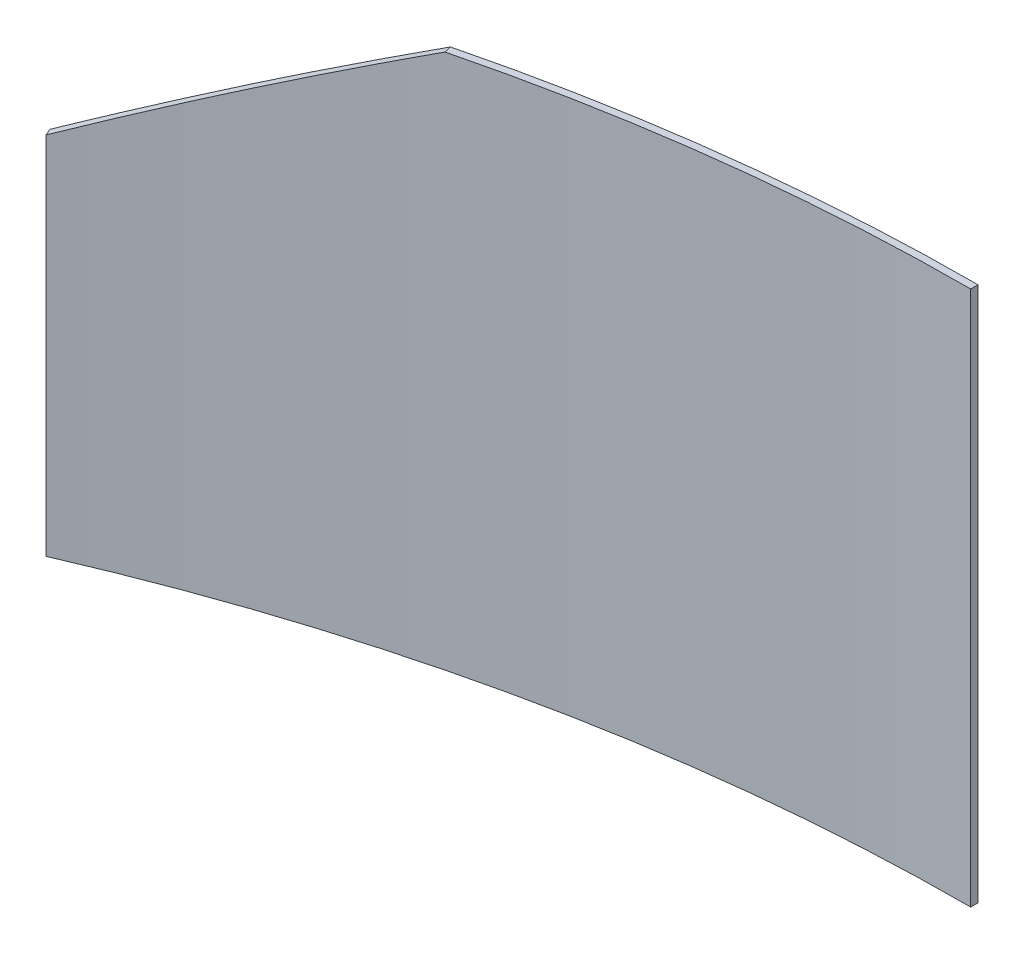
ISO-10303-21;
HEADER;
FILE_DESCRIPTION(('STEP AP214'),'2;1');
FILE_NAME('part.step','',(''),(''),'','','');
FILE_SCHEMA(('AUTOMOTIVE_DESIGN { 1 0 10303 214 1 1 1 1 }'));
ENDSEC;
DATA;
#1=APPLICATION_CONTEXT('core data for automotive mechanical design processes');
#2=APPLICATION_PROTOCOL_DEFINITION('international standard','automotive_design',2000,#1);
#3=PRODUCT_CONTEXT('',#1,'mechanical');
#4=PRODUCT('Part','Part','',(#3));
#5=PRODUCT_RELATED_PRODUCT_CATEGORY('part','',(#4));
#6=PRODUCT_DEFINITION_FORMATION('','',#4);
#7=PRODUCT_DEFINITION_CONTEXT('part definition',#1,'design');
#8=PRODUCT_DEFINITION('design','',#6,#7);
#9=PRODUCT_DEFINITION_SHAPE('','',#8);
#10=(LENGTH_UNIT() NAMED_UNIT(*) SI_UNIT(.MILLI.,.METRE.));
#11=(NAMED_UNIT(*) PLANE_ANGLE_UNIT() SI_UNIT($,.RADIAN.));
#12=(NAMED_UNIT(*) SI_UNIT($,.STERADIAN.) SOLID_ANGLE_UNIT());
#13=UNCERTAINTY_MEASURE_WITH_UNIT(LENGTH_MEASURE(1.E-05),#10,'distance_accuracy_value','');
#14=(GEOMETRIC_REPRESENTATION_CONTEXT(3) GLOBAL_UNCERTAINTY_ASSIGNED_CONTEXT((#13)) GLOBAL_UNIT_ASSIGNED_CONTEXT((#10,
#11,#12)) REPRESENTATION_CONTEXT('',''));
#15=CARTESIAN_POINT('',(0.,0.,0.));
#16=DIRECTION('',(0.,0.,1.));
#17=DIRECTION('',(1.,0.,0.));
#18=AXIS2_PLACEMENT_3D('',#15,#16,#17);
#19=CARTESIAN_POINT('',(-4.44089209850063E-13,220.,6.66133814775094E-13));
#20=DIRECTION('',(0.,-1.,0.));
#21=DIRECTION('',(0.,0.,-1.));
#22=AXIS2_PLACEMENT_3D('',#19,#20,#21);
#23=PLANE('',#22);
#24=DIRECTION('',(0.,0.,1.));
#25=VECTOR('',#24,1.);
#26=CARTESIAN_POINT('',(0.,220.,-793.));
#27=LINE('',#26,#25);
#28=CARTESIAN_POINT('',(1.11022302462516E-13,220.,-796.));
#29=VERTEX_POINT('',#28);
#30=CARTESIAN_POINT('',(0.,220.,-793.));
#31=VERTEX_POINT('',#30);
#32=EDGE_CURVE('E12',#29,#31,#27,.T.);
#33=ORIENTED_EDGE('',*,*,#32,.F.);
#34=CARTESIAN_POINT('',(-4.44089209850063E-13,220.,6.66133814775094E-13));
#35=DIRECTION('',(0.,-1.,0.));
#36=DIRECTION('',(0.,0.,-1.));
#37=AXIS2_PLACEMENT_3D('',#34,#35,#36);
#38=CIRCLE('',#37,796.);
#39=CARTESIAN_POINT('',(-193.055431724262,220.,-772.23416156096));
#40=VERTEX_POINT('',#39);
#41=EDGE_CURVE('E104',#29,#40,#38,.F.);
#42=ORIENTED_EDGE('',*,*,#41,.T.);
#43=CARTESIAN_POINT('',(-192.327835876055,220.,-769.323731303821));
#44=CARTESIAN_POINT('',(-193.055431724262,220.,-772.23416156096));
#45=B_SPLINE_CURVE_WITH_KNOTS('',1,(#43,#44),.UNSPECIFIED.,.F.,.F.,(2,2),(0.,1.),.UNSPECIFIED.);
#46=CARTESIAN_POINT('',(-192.327835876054,220.,-769.323731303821));
#47=VERTEX_POINT('',#46);
#48=EDGE_CURVE('E47',#40,#47,#45,.F.);
#49=ORIENTED_EDGE('',*,*,#48,.T.);
#50=CARTESIAN_POINT('',(-4.44089209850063E-13,220.,6.66133814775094E-13));
#51=DIRECTION('',(0.,1.,0.));
#52=DIRECTION('',(0.,0.,1.));
#53=AXIS2_PLACEMENT_3D('',#50,#51,#52);
#54=CIRCLE('',#53,793.);
#55=EDGE_CURVE('E170',#31,#47,#54,.T.);
#56=ORIENTED_EDGE('',*,*,#55,.F.);
#57=EDGE_LOOP('',(#33,#42,#49,#56));
#58=FACE_BOUND('',#57,.T.);
#59=ADVANCED_FACE('F38',(#58),#23,.F.);
#60=CARTESIAN_POINT('',(-193.055431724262,220.,-772.23416156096));
#61=CARTESIAN_POINT('',(-235.095669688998,196.666283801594,-761.724271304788));
#62=CARTESIAN_POINT('',(-276.273269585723,173.333716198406,-747.774645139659));
#63=CARTESIAN_POINT('',(-316.045278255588,150.000000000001,-730.569217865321));
#64=CARTESIAN_POINT('',(-192.327835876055,220.,-769.323731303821));
#65=CARTESIAN_POINT('',(-234.209629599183,196.666284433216,-758.853451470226));
#66=CARTESIAN_POINT('',(-275.232039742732,173.333715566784,-744.956398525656));
#67=CARTESIAN_POINT('',(-314.854152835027,150.000000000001,-727.815816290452));
#68=B_SPLINE_SURFACE_WITH_KNOTS('',1,3,((#60,#61,#62,#63),(#64,#65,#66,#67)),.UNSPECIFIED.,.F.,
.F.,.F.,(2,2),(4,4),(0.,1.),(0.,1.),.UNSPECIFIED.);
#69=CARTESIAN_POINT('',(-193.055431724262,220.,-772.23416156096));
#70=CARTESIAN_POINT('',(-235.095669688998,196.666283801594,-761.724271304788));
#71=CARTESIAN_POINT('',(-276.273269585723,173.333716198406,-747.774645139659));
#72=CARTESIAN_POINT('',(-316.045278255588,150.000000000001,-730.569217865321));
#73=B_SPLINE_CURVE_WITH_KNOTS('',3,(#69,#70,#71,#72),.UNSPECIFIED.,.F.,.F.,(4,4),(0.,1.),.UNSPECIFIED.);
#74=CARTESIAN_POINT('',(-316.045278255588,150.000000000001,-730.569217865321));
#75=VERTEX_POINT('',#74);
#76=EDGE_CURVE('E102',#40,#75,#73,.T.);
#77=CARTESIAN_POINT('',(-316.045278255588,150.000000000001,-730.569217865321));
#78=CARTESIAN_POINT('',(-314.854152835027,150.000000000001,-727.815816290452));
#79=B_SPLINE_CURVE_WITH_KNOTS('',1,(#77,#78),.UNSPECIFIED.,.F.,.F.,(2,2),(0.,1.),.UNSPECIFIED.);
#80=CARTESIAN_POINT('',(-314.854152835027,150.000000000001,-727.815816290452));
#81=VERTEX_POINT('',#80);
#82=EDGE_CURVE('E88',#75,#81,#79,.T.);
#83=CARTESIAN_POINT('',(-314.854152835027,150.000000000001,-727.815816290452));
#84=CARTESIAN_POINT('',(-275.232039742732,173.333715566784,-744.956398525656));
#85=CARTESIAN_POINT('',(-234.209629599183,196.666284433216,-758.853451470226));
#86=CARTESIAN_POINT('',(-192.327835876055,220.,-769.323731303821));
#87=B_SPLINE_CURVE_WITH_KNOTS('',3,(#83,#84,#85,#86),.UNSPECIFIED.,.F.,.F.,(4,4),(0.,1.),.UNSPECIFIED.);
#88=EDGE_CURVE('E177',#47,#81,#87,.F.);
#89=ORIENTED_EDGE('',*,*,#48,.F.);
#90=ORIENTED_EDGE('',*,*,#76,.T.);
#91=ORIENTED_EDGE('',*,*,#82,.T.);
#92=ORIENTED_EDGE('',*,*,#88,.F.);
#93=EDGE_LOOP('',(#89,#90,#91,#92));
#94=FACE_BOUND('',#93,.T.);
#95=ADVANCED_FACE('F135',(#94),#68,.F.);
#96=CARTESIAN_POINT('',(-314.854152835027,74.9999999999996,-727.815816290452));
#97=DIRECTION('',(0.917800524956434,0.,-0.397041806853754));
#98=DIRECTION('',(0.,-1.,0.));
#99=AXIS2_PLACEMENT_3D('',#96,#97,#98);
#100=PLANE('',#99);
#101=ORIENTED_EDGE('',*,*,#82,.F.);
#102=DIRECTION('',(0.,-1.,0.));
#103=VECTOR('',#102,1.);
#104=CARTESIAN_POINT('',(-316.045278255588,502.471655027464,-730.569217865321));
#105=LINE('',#104,#103);
#106=CARTESIAN_POINT('',(-316.045278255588,0.,-730.569217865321));
#107=VERTEX_POINT('',#106);
#108=EDGE_CURVE('E94',#75,#107,#105,.T.);
#109=ORIENTED_EDGE('',*,*,#108,.T.);
#110=DIRECTION('',(0.397041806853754,0.,0.917800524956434));
#111=VECTOR('',#110,1.);
#112=CARTESIAN_POINT('',(-314.854152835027,0.,-727.815816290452));
#113=LINE('',#112,#111);
#114=CARTESIAN_POINT('',(-314.854152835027,0.,-727.815816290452));
#115=VERTEX_POINT('',#114);
#116=EDGE_CURVE('E61',#107,#115,#113,.T.);
#117=ORIENTED_EDGE('',*,*,#116,.T.);
#118=DIRECTION('',(0.,-1.,0.));
#119=VECTOR('',#118,1.);
#120=CARTESIAN_POINT('',(-314.854152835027,150.000000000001,-727.815816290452));
#121=LINE('',#120,#119);
#122=EDGE_CURVE('E115',#81,#115,#121,.T.);
#123=ORIENTED_EDGE('',*,*,#122,.F.);
#124=EDGE_LOOP('',(#101,#109,#117,#123));
#125=FACE_BOUND('',#124,.T.);
#126=ADVANCED_FACE('F100',(#125),#100,.F.);
#127=CARTESIAN_POINT('',(0.,0.,0.));
#128=DIRECTION('',(0.,1.,0.));
#129=DIRECTION('',(0.,0.,1.));
#130=AXIS2_PLACEMENT_3D('',#127,#128,#129);
#131=PLANE('',#130);
#132=ORIENTED_EDGE('',*,*,#116,.F.);
#133=CARTESIAN_POINT('',(0.,0.,0.));
#134=DIRECTION('',(0.,-1.,0.));
#135=DIRECTION('',(0.,0.,-1.));
#136=AXIS2_PLACEMENT_3D('',#133,#134,#135);
#137=CIRCLE('',#136,796.);
#138=CARTESIAN_POINT('',(0.,0.,-796.));
#139=VERTEX_POINT('',#138);
#140=EDGE_CURVE('E85',#107,#139,#137,.T.);
#141=ORIENTED_EDGE('',*,*,#140,.T.);
#142=DIRECTION('',(0.,0.,1.));
#143=VECTOR('',#142,1.);
#144=CARTESIAN_POINT('',(0.,0.,-793.));
#145=LINE('',#144,#143);
#146=CARTESIAN_POINT('',(0.,0.,-793.));
#147=VERTEX_POINT('',#146);
#148=EDGE_CURVE('E42',#139,#147,#145,.T.);
#149=ORIENTED_EDGE('',*,*,#148,.T.);
#150=CARTESIAN_POINT('',(0.,0.,0.));
#151=DIRECTION('',(0.,-1.,0.));
#152=DIRECTION('',(0.,0.,-1.));
#153=AXIS2_PLACEMENT_3D('',#150,#151,#152);
#154=CIRCLE('',#153,793.);
#155=EDGE_CURVE('E87',#115,#147,#154,.T.);
#156=ORIENTED_EDGE('',*,*,#155,.F.);
#157=EDGE_LOOP('',(#132,#141,#149,#156));
#158=FACE_BOUND('',#157,.T.);
#159=ADVANCED_FACE('F84',(#158),#131,.F.);
#160=CARTESIAN_POINT('',(0.,110.,-793.));
#161=DIRECTION('',(-1.,0.,0.));
#162=DIRECTION('',(0.,1.,0.));
#163=AXIS2_PLACEMENT_3D('',#160,#161,#162);
#164=PLANE('',#163);
#165=DIRECTION('',(0.,-1.,0.));
#166=VECTOR('',#165,1.);
#167=CARTESIAN_POINT('',(2.22044604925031E-13,502.471655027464,-796.));
#168=LINE('',#167,#166);
#169=EDGE_CURVE('E98',#139,#29,#168,.F.);
#170=ORIENTED_EDGE('',*,*,#169,.T.);
#171=ORIENTED_EDGE('',*,*,#32,.T.);
#172=DIRECTION('',(0.,1.,0.));
#173=VECTOR('',#172,1.);
#174=CARTESIAN_POINT('',(0.,0.,-793.));
#175=LINE('',#174,#173);
#176=EDGE_CURVE('E107',#147,#31,#175,.T.);
#177=ORIENTED_EDGE('',*,*,#176,.F.);
#178=ORIENTED_EDGE('',*,*,#148,.F.);
#179=EDGE_LOOP('',(#170,#171,#177,#178));
#180=FACE_BOUND('',#179,.T.);
#181=ADVANCED_FACE('F40',(#180),#164,.F.);
#182=CARTESIAN_POINT('',(0.,502.471655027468,0.));
#183=DIRECTION('',(0.,-1.,0.));
#184=DIRECTION('',(0.,0.,-1.));
#185=AXIS2_PLACEMENT_3D('',#182,#183,#184);
#186=CYLINDRICAL_SURFACE('',#185,793.);
#187=ORIENTED_EDGE('',*,*,#155,.T.);
#188=ORIENTED_EDGE('',*,*,#176,.T.);
#189=ORIENTED_EDGE('',*,*,#55,.T.);
#190=ORIENTED_EDGE('',*,*,#88,.T.);
#191=ORIENTED_EDGE('',*,*,#122,.T.);
#192=EDGE_LOOP('',(#187,#188,#189,#190,#191));
#193=FACE_BOUND('',#192,.T.);
#194=ADVANCED_FACE('F118',(#193),#186,.F.);
#195=CARTESIAN_POINT('',(0.,502.471655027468,0.));
#196=DIRECTION('',(0.,-1.,0.));
#197=DIRECTION('',(0.,0.,-1.));
#198=AXIS2_PLACEMENT_3D('',#195,#196,#197);
#199=CYLINDRICAL_SURFACE('',#198,796.);
#200=ORIENTED_EDGE('',*,*,#140,.F.);
#201=ORIENTED_EDGE('',*,*,#108,.F.);
#202=ORIENTED_EDGE('',*,*,#76,.F.);
#203=ORIENTED_EDGE('',*,*,#41,.F.);
#204=ORIENTED_EDGE('',*,*,#169,.F.);
#205=EDGE_LOOP('',(#200,#201,#202,#203,#204));
#206=FACE_BOUND('',#205,.T.);
#207=ADVANCED_FACE('F92',(#206),#199,.T.);
#208=CLOSED_SHELL('',(#59,#95,#126,#159,#181,#194,#207));
#209=MANIFOLD_SOLID_BREP('B2',#208);
#210=ADVANCED_BREP_SHAPE_REPRESENTATION('',(#18,#209),#14);
#211=SHAPE_DEFINITION_REPRESENTATION(#9,#210);
ENDSEC;
END-ISO-10303-21;
